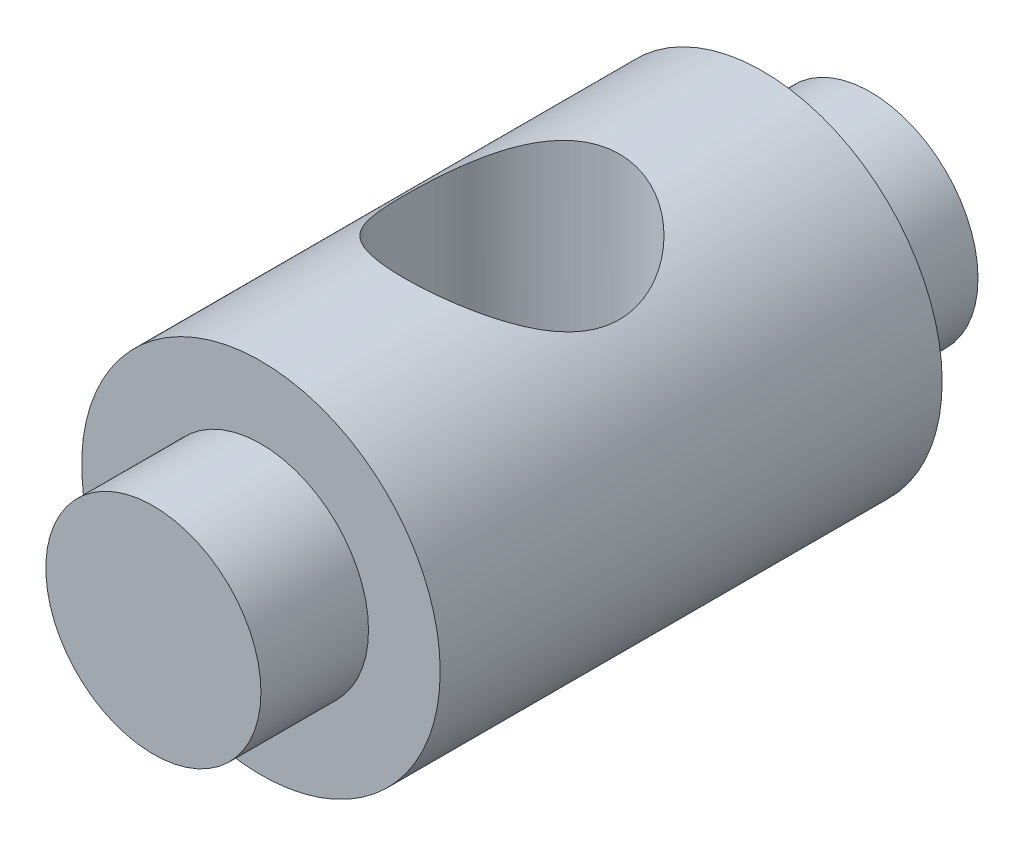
ISO-10303-21;
HEADER;
FILE_DESCRIPTION(('STEP AP214'),'2;1');
FILE_NAME('part.step','',(''),(''),'','','');
FILE_SCHEMA(('AUTOMOTIVE_DESIGN { 1 0 10303 214 1 1 1 1 }'));
ENDSEC;
DATA;
#1=APPLICATION_CONTEXT('core data for automotive mechanical design processes');
#2=APPLICATION_PROTOCOL_DEFINITION('international standard','automotive_design',2000,#1);
#3=PRODUCT_CONTEXT('',#1,'mechanical');
#4=PRODUCT('Part','Part','',(#3));
#5=PRODUCT_RELATED_PRODUCT_CATEGORY('part','',(#4));
#6=PRODUCT_DEFINITION_FORMATION('','',#4);
#7=PRODUCT_DEFINITION_CONTEXT('part definition',#1,'design');
#8=PRODUCT_DEFINITION('design','',#6,#7);
#9=PRODUCT_DEFINITION_SHAPE('','',#8);
#10=(LENGTH_UNIT() NAMED_UNIT(*) SI_UNIT(.MILLI.,.METRE.));
#11=(NAMED_UNIT(*) PLANE_ANGLE_UNIT() SI_UNIT($,.RADIAN.));
#12=(NAMED_UNIT(*) SI_UNIT($,.STERADIAN.) SOLID_ANGLE_UNIT());
#13=UNCERTAINTY_MEASURE_WITH_UNIT(LENGTH_MEASURE(1.E-05),#10,'distance_accuracy_value','');
#14=(GEOMETRIC_REPRESENTATION_CONTEXT(3) GLOBAL_UNCERTAINTY_ASSIGNED_CONTEXT((#13)) GLOBAL_UNIT_ASSIGNED_CONTEXT((#10,
#11,#12)) REPRESENTATION_CONTEXT('',''));
#15=CARTESIAN_POINT('',(0.,0.,0.));
#16=DIRECTION('',(0.,0.,1.));
#17=DIRECTION('',(1.,0.,0.));
#18=AXIS2_PLACEMENT_3D('',#15,#16,#17);
#19=CARTESIAN_POINT('',(0.,0.,-7.));
#20=DIRECTION('',(0.,0.,1.));
#21=DIRECTION('',(1.,0.,0.));
#22=AXIS2_PLACEMENT_3D('',#19,#20,#21);
#23=CYLINDRICAL_SURFACE('',#22,5.);
#24=CARTESIAN_POINT('',(0.,5.,3.));
#25=CARTESIAN_POINT('',(0.0767697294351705,4.99999907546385,2.99999894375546));
#26=CARTESIAN_POINT('',(0.153562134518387,4.99822567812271,2.99704640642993));
#27=CARTESIAN_POINT('',(0.306548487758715,4.99118362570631,2.98528576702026));
#28=CARTESIAN_POINT('',(0.382742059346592,4.98591292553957,2.97647423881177));
#29=CARTESIAN_POINT('',(0.609808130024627,4.96499345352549,2.94135144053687));
#30=CARTESIAN_POINT('',(0.758981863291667,4.94423772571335,2.90635229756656));
#31=CARTESIAN_POINT('',(1.04754167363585,4.89123238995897,2.81522725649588));
#32=CARTESIAN_POINT('',(1.18697226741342,4.8590397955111,2.75920607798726));
#33=CARTESIAN_POINT('',(1.45405042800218,4.7859070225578,2.62827933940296));
#34=CARTESIAN_POINT('',(1.58170090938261,4.74496901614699,2.55337846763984));
#35=CARTESIAN_POINT('',(1.83260160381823,4.65410731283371,2.38045034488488));
#36=CARTESIAN_POINT('',(1.95476885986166,4.60373587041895,2.28109260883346));
#37=CARTESIAN_POINT('',(2.1817645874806,4.50060875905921,2.06506559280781));
#38=CARTESIAN_POINT('',(2.28657046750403,4.4478500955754,1.94837412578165));
#39=CARTESIAN_POINT('',(2.48890019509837,4.33822134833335,1.68415297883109));
#40=CARTESIAN_POINT('',(2.5839553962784,4.28164035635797,1.53459645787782));
#41=CARTESIAN_POINT('',(2.74722868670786,4.17876602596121,1.21830685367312));
#42=CARTESIAN_POINT('',(2.8154903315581,4.13245604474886,1.05160220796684));
#43=CARTESIAN_POINT('',(2.90881204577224,4.06709259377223,0.746807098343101));
#44=CARTESIAN_POINT('',(2.94032394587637,4.04415766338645,0.611528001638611));
#45=CARTESIAN_POINT('',(2.98432344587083,4.01180616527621,0.336392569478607));
#46=CARTESIAN_POINT('',(2.99683469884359,4.00237279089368,0.196542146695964));
#47=CARTESIAN_POINT('',(3.0021101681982,3.99841845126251,-0.0840229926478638));
#48=CARTESIAN_POINT('',(2.99483563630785,4.00392674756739,-0.224738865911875));
#49=CARTESIAN_POINT('',(2.96092124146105,4.02906522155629,-0.502557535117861));
#50=CARTESIAN_POINT('',(2.93426681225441,4.04870602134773,-0.63965753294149));
#51=CARTESIAN_POINT('',(2.86347831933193,4.09906376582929,-0.90506054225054));
#52=CARTESIAN_POINT('',(2.8195745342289,4.12963433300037,-1.03345432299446));
#53=CARTESIAN_POINT('',(2.7159016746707,4.19854092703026,-1.2813897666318));
#54=CARTESIAN_POINT('',(2.65612678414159,4.2368797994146,-1.40092816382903));
#55=CARTESIAN_POINT('',(2.5103577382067,4.32510698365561,-1.64996913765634));
#56=CARTESIAN_POINT('',(2.42160671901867,4.3758426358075,-1.77755999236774));
#57=CARTESIAN_POINT('',(2.22582963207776,4.4786102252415,-2.01734915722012));
#58=CARTESIAN_POINT('',(2.11878609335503,4.53064336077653,-2.12953256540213));
#59=CARTESIAN_POINT('',(1.87159040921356,4.63871766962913,-2.35124225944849));
#60=CARTESIAN_POINT('',(1.72890315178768,4.69430681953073,-2.45821939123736));
#61=CARTESIAN_POINT('',(1.50061053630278,4.77018325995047,-2.59926871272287));
#62=CARTESIAN_POINT('',(1.42209821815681,4.79423315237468,-2.64306413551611));
#63=CARTESIAN_POINT('',(1.26074368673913,4.83916496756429,-2.723718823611));
#64=CARTESIAN_POINT('',(1.17790417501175,4.86004883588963,-2.76058235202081));
#65=CARTESIAN_POINT('',(1.01376371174,4.8968267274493,-2.82481144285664));
#66=CARTESIAN_POINT('',(0.932690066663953,4.91295100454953,-2.85262656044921));
#67=CARTESIAN_POINT('',(0.767879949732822,4.94139126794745,-2.90133395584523));
#68=CARTESIAN_POINT('',(0.684144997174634,4.95370938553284,-2.92223010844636));
#69=CARTESIAN_POINT('',(0.51474446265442,4.97416370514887,-2.95677185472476));
#70=CARTESIAN_POINT('',(0.429080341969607,4.98230296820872,-2.97042275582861));
#71=CARTESIAN_POINT('',(0.256621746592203,4.99415996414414,-2.9902661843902));
#72=CARTESIAN_POINT('',(0.169827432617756,4.99787831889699,-2.99645976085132));
#73=CARTESIAN_POINT('',(-0.0673242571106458,5.00179157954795,-3.00299267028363));
#74=CARTESIAN_POINT('',(-0.218056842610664,4.99746512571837,-2.9958115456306));
#75=CARTESIAN_POINT('',(-0.515686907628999,4.97557955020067,-2.9591544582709));
#76=CARTESIAN_POINT('',(-0.662584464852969,4.95802069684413,-2.92967894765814));
#77=CARTESIAN_POINT('',(-0.945142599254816,4.91189447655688,-2.85091154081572));
#78=CARTESIAN_POINT('',(-1.08098954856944,4.88360514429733,-2.80211887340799));
#79=CARTESIAN_POINT('',(-1.34253345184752,4.81827798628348,-2.68664567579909));
#80=CARTESIAN_POINT('',(-1.46822839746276,4.78123843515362,-2.61996161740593));
#81=CARTESIAN_POINT('',(-1.7200119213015,4.69690981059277,-2.46288590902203));
#82=CARTESIAN_POINT('',(-1.84478813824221,4.6489560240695,-2.37075230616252));
#83=CARTESIAN_POINT('',(-2.07805222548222,4.54948534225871,-2.16921724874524));
#84=CARTESIAN_POINT('',(-2.18652085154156,4.49796434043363,-2.05979570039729));
#85=CARTESIAN_POINT('',(-2.39863988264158,4.38890846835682,-1.81017920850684));
#86=CARTESIAN_POINT('',(-2.49982037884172,4.33146483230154,-1.66783222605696));
#87=CARTESIAN_POINT('',(-2.67690479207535,4.22432364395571,-1.36556795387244));
#88=CARTESIAN_POINT('',(-2.75283533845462,4.1746179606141,-1.20566941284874));
#89=CARTESIAN_POINT('',(-2.86285157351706,4.09969818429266,-0.907513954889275));
#90=CARTESIAN_POINT('',(-2.90243250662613,4.07151318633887,-0.772039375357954));
#91=CARTESIAN_POINT('',(-2.96227327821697,4.02819211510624,-0.494935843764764));
#92=CARTESIAN_POINT('',(-2.98255990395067,4.01303795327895,-0.353315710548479));
#93=CARTESIAN_POINT('',(-3.00268261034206,3.99800893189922,-0.0672461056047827));
#94=CARTESIAN_POINT('',(-3.00244179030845,3.99819152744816,0.0772119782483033));
#95=CARTESIAN_POINT('',(-2.98132945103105,4.01395435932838,0.3637888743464));
#96=CARTESIAN_POINT('',(-2.96044671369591,4.02954296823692,0.505906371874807));
#97=CARTESIAN_POINT('',(-2.90080351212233,4.07266369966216,0.776976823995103));
#98=CARTESIAN_POINT('',(-2.86295284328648,4.09958421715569,0.906234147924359));
#99=CARTESIAN_POINT('',(-2.77126473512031,4.16211005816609,1.15667454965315));
#100=CARTESIAN_POINT('',(-2.7174212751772,4.19771865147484,1.27785456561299));
#101=CARTESIAN_POINT('',(-2.58578536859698,4.28025972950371,1.52863953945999));
#102=CARTESIAN_POINT('',(-2.50558518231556,4.32809142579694,1.65668150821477));
#103=CARTESIAN_POINT('',(-2.32751213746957,4.42640286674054,1.8987608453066));
#104=CARTESIAN_POINT('',(-2.22962472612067,4.47688476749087,2.01278655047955));
#105=CARTESIAN_POINT('',(-2.00020353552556,4.5845123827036,2.24269884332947));
#106=CARTESIAN_POINT('',(-1.86578571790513,4.64140045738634,2.35584987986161));
#107=CARTESIAN_POINT('',(-1.57689277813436,4.74731429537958,2.55820798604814));
#108=CARTESIAN_POINT('',(-1.42241049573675,4.79633723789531,2.64740647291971));
#109=CARTESIAN_POINT('',(-1.18102189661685,4.85920558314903,2.75912447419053));
#110=CARTESIAN_POINT('',(-1.10025014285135,4.87817139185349,2.79233599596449));
#111=CARTESIAN_POINT('',(-0.935442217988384,4.91243413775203,2.85177213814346));
#112=CARTESIAN_POINT('',(-0.851407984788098,4.9277332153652,2.87800083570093));
#113=CARTESIAN_POINT('',(-0.681001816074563,4.95415527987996,2.92300944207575));
#114=CARTESIAN_POINT('',(-0.594637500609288,4.9652904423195,2.94181107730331));
#115=CARTESIAN_POINT('',(-0.420183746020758,4.98308318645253,2.97174435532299));
#116=CARTESIAN_POINT('',(-0.332095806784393,4.98974449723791,2.98288238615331));
#117=CARTESIAN_POINT('',(-0.203123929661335,4.99603728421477,2.99339168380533));
#118=CARTESIAN_POINT('',(-0.162556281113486,4.99752198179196,2.995868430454));
#119=CARTESIAN_POINT('',(-0.0813278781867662,4.99950360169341,2.99917289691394));
#120=CARTESIAN_POINT('',(-0.040667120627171,5.00000048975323,3.00000055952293));
#121=CARTESIAN_POINT('',(0.,5.,3.));
#122=B_SPLINE_CURVE_WITH_KNOTS('',3,(#24,#25,#26,#27,#28,#29,#30,#31,#32,#33,#34,#35,#36,#37,
#38,#39,#40,#41,#42,#43,#44,#45,#46,#47,#48,#49,#50,#51,#52,#53,#54,#55,#56,#57,#58,#59,#60,#61,
#62,#63,#64,#65,#66,#67,#68,#69,#70,#71,#72,#73,#74,#75,#76,#77,#78,#79,#80,#81,#82,#83,#84,#85,
#86,#87,#88,#89,#90,#91,#92,#93,#94,#95,#96,#97,#98,#99,#100,#101,#102,#103,#104,#105,#106,#107,
#108,#109,#110,#111,#112,#113,#114,#115,#116,#117,#118,#119,#120,#121),.UNSPECIFIED.,.T.,.F.,(4,
2,2,2,2,2,2,2,2,2,2,2,2,2,2,2,2,2,2,2,2,2,2,2,2,2,2,2,2,2,2,2,2,2,2,2,2,2,2,2,2,2,2,2,2,2,2,2,
4),(0.,0.230263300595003,0.4606613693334,0.922002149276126,1.38107466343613,1.84003329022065,
2.33408870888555,2.82878205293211,3.38413315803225,3.93857770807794,4.35913349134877,
4.77916531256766,5.20002031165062,5.62119195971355,6.03692224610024,6.45280509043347,
6.94139679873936,7.43045779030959,7.98767605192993,8.26653157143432,8.54521503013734,
8.80648473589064,9.06760787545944,9.32853946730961,9.58943435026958,10.0398406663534,
10.490237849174,10.9296843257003,11.3692175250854,11.8543559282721,12.3400624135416,
12.8890638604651,13.437484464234,13.8674843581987,14.2968863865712,14.7278971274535,
15.1591422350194,15.5696105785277,15.9802336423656,16.4539008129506,16.927959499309,
17.4794148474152,18.0310675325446,18.2988384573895,18.5664526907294,18.8332781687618,
19.0998809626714,19.221853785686,19.3438308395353),.UNSPECIFIED.);
#123=CARTESIAN_POINT('',(0.,5.,3.));
#124=VERTEX_POINT('',#123);
#125=EDGE_CURVE('E10',#124,#124,#122,.T.);
#126=ORIENTED_EDGE('',*,*,#125,.F.);
#127=EDGE_LOOP('',(#126));
#128=FACE_BOUND('',#127,.T.);
#129=CARTESIAN_POINT('',(0.,0.,-7.));
#130=DIRECTION('',(0.,0.,1.));
#131=DIRECTION('',(1.,0.,0.));
#132=AXIS2_PLACEMENT_3D('',#129,#130,#131);
#133=CIRCLE('',#132,5.);
#134=CARTESIAN_POINT('',(5.,0.,-7.));
#135=VERTEX_POINT('',#134);
#136=EDGE_CURVE('E54',#135,#135,#133,.T.);
#137=ORIENTED_EDGE('',*,*,#136,.T.);
#138=EDGE_LOOP('',(#137));
#139=FACE_BOUND('',#138,.T.);
#140=CARTESIAN_POINT('',(0.,0.,7.));
#141=DIRECTION('',(0.,0.,1.));
#142=DIRECTION('',(1.,0.,0.));
#143=AXIS2_PLACEMENT_3D('',#140,#141,#142);
#144=CIRCLE('',#143,5.);
#145=CARTESIAN_POINT('',(5.,0.,7.));
#146=VERTEX_POINT('',#145);
#147=EDGE_CURVE('E60',#146,#146,#144,.T.);
#148=ORIENTED_EDGE('',*,*,#147,.F.);
#149=EDGE_LOOP('',(#148));
#150=FACE_BOUND('',#149,.T.);
#151=ADVANCED_FACE('F37',(#128,#139,#150),#23,.T.);
#152=CARTESIAN_POINT('',(0.,0.,-7.));
#153=DIRECTION('',(0.,0.,1.));
#154=DIRECTION('',(1.,0.,0.));
#155=AXIS2_PLACEMENT_3D('',#152,#153,#154);
#156=PLANE('',#155);
#157=CARTESIAN_POINT('',(0.,0.,-7.));
#158=DIRECTION('',(0.,0.,1.));
#159=DIRECTION('',(1.,0.,0.));
#160=AXIS2_PLACEMENT_3D('',#157,#158,#159);
#161=CIRCLE('',#160,3.);
#162=CARTESIAN_POINT('',(3.,0.,-7.));
#163=VERTEX_POINT('',#162);
#164=EDGE_CURVE('E76',#163,#163,#161,.T.);
#165=ORIENTED_EDGE('',*,*,#164,.T.);
#166=EDGE_LOOP('',(#165));
#167=FACE_BOUND('',#166,.T.);
#168=ORIENTED_EDGE('',*,*,#136,.F.);
#169=EDGE_LOOP('',(#168));
#170=FACE_BOUND('',#169,.T.);
#171=ADVANCED_FACE('F103',(#167,#170),#156,.F.);
#172=CARTESIAN_POINT('',(0.,0.,7.));
#173=DIRECTION('',(0.,0.,1.));
#174=DIRECTION('',(1.,0.,0.));
#175=AXIS2_PLACEMENT_3D('',#172,#173,#174);
#176=PLANE('',#175);
#177=CARTESIAN_POINT('',(0.,0.,7.));
#178=DIRECTION('',(0.,0.,1.));
#179=DIRECTION('',(1.,0.,0.));
#180=AXIS2_PLACEMENT_3D('',#177,#178,#179);
#181=CIRCLE('',#180,3.);
#182=CARTESIAN_POINT('',(3.,0.,7.));
#183=VERTEX_POINT('',#182);
#184=EDGE_CURVE('E49',#183,#183,#181,.T.);
#185=ORIENTED_EDGE('',*,*,#184,.F.);
#186=EDGE_LOOP('',(#185));
#187=FACE_BOUND('',#186,.T.);
#188=ORIENTED_EDGE('',*,*,#147,.T.);
#189=EDGE_LOOP('',(#188));
#190=FACE_BOUND('',#189,.T.);
#191=ADVANCED_FACE('F108',(#187,#190),#176,.T.);
#192=CARTESIAN_POINT('',(0.,0.,10.));
#193=DIRECTION('',(0.,0.,-1.));
#194=DIRECTION('',(-1.,0.,0.));
#195=AXIS2_PLACEMENT_3D('',#192,#193,#194);
#196=CYLINDRICAL_SURFACE('',#195,3.);
#197=CARTESIAN_POINT('',(0.,0.,10.));
#198=DIRECTION('',(0.,0.,1.));
#199=DIRECTION('',(1.,0.,0.));
#200=AXIS2_PLACEMENT_3D('',#197,#198,#199);
#201=CIRCLE('',#200,3.);
#202=CARTESIAN_POINT('',(3.,0.,10.));
#203=VERTEX_POINT('',#202);
#204=EDGE_CURVE('E63',#203,#203,#201,.T.);
#205=ORIENTED_EDGE('',*,*,#204,.F.);
#206=EDGE_LOOP('',(#205));
#207=FACE_BOUND('',#206,.T.);
#208=ORIENTED_EDGE('',*,*,#184,.T.);
#209=EDGE_LOOP('',(#208));
#210=FACE_BOUND('',#209,.T.);
#211=ADVANCED_FACE('F117',(#207,#210),#196,.T.);
#212=CARTESIAN_POINT('',(0.,0.,10.));
#213=DIRECTION('',(0.,0.,1.));
#214=DIRECTION('',(1.,0.,0.));
#215=AXIS2_PLACEMENT_3D('',#212,#213,#214);
#216=PLANE('',#215);
#217=ORIENTED_EDGE('',*,*,#204,.T.);
#218=EDGE_LOOP('',(#217));
#219=FACE_BOUND('',#218,.T.);
#220=ADVANCED_FACE('F123',(#219),#216,.T.);
#221=CARTESIAN_POINT('',(0.,0.,-10.));
#222=DIRECTION('',(0.,0.,1.));
#223=DIRECTION('',(1.,0.,0.));
#224=AXIS2_PLACEMENT_3D('',#221,#222,#223);
#225=CYLINDRICAL_SURFACE('',#224,3.);
#226=CARTESIAN_POINT('',(0.,0.,-10.));
#227=DIRECTION('',(0.,0.,1.));
#228=DIRECTION('',(1.,0.,0.));
#229=AXIS2_PLACEMENT_3D('',#226,#227,#228);
#230=CIRCLE('',#229,3.);
#231=CARTESIAN_POINT('',(3.,0.,-10.));
#232=VERTEX_POINT('',#231);
#233=EDGE_CURVE('E71',#232,#232,#230,.T.);
#234=ORIENTED_EDGE('',*,*,#233,.T.);
#235=EDGE_LOOP('',(#234));
#236=FACE_BOUND('',#235,.T.);
#237=ORIENTED_EDGE('',*,*,#164,.F.);
#238=EDGE_LOOP('',(#237));
#239=FACE_BOUND('',#238,.T.);
#240=ADVANCED_FACE('F98',(#236,#239),#225,.T.);
#241=CARTESIAN_POINT('',(0.,0.,-10.));
#242=DIRECTION('',(0.,0.,-1.));
#243=DIRECTION('',(1.,0.,0.));
#244=AXIS2_PLACEMENT_3D('',#241,#242,#243);
#245=PLANE('',#244);
#246=ORIENTED_EDGE('',*,*,#233,.F.);
#247=EDGE_LOOP('',(#246));
#248=FACE_BOUND('',#247,.T.);
#249=ADVANCED_FACE('F92',(#248),#245,.T.);
#250=CARTESIAN_POINT('',(0.,0.,0.));
#251=DIRECTION('',(0.,1.,0.));
#252=DIRECTION('',(0.,0.,1.));
#253=AXIS2_PLACEMENT_3D('',#250,#251,#252);
#254=CYLINDRICAL_SURFACE('',#253,3.);
#255=ORIENTED_EDGE('',*,*,#125,.T.);
#256=EDGE_LOOP('',(#255));
#257=FACE_BOUND('',#256,.T.);
#258=CARTESIAN_POINT('',(0.,0.,0.));
#259=DIRECTION('',(0.,1.,0.));
#260=DIRECTION('',(0.,0.,1.));
#261=AXIS2_PLACEMENT_3D('',#258,#259,#260);
#262=CIRCLE('',#261,3.);
#263=CARTESIAN_POINT('',(0.,0.,3.));
#264=VERTEX_POINT('',#263);
#265=EDGE_CURVE('E82',#264,#264,#262,.T.);
#266=ORIENTED_EDGE('',*,*,#265,.F.);
#267=EDGE_LOOP('',(#266));
#268=FACE_BOUND('',#267,.T.);
#269=ADVANCED_FACE('F90',(#257,#268),#254,.F.);
#270=CARTESIAN_POINT('',(0.,0.,0.));
#271=DIRECTION('',(0.,1.,0.));
#272=DIRECTION('',(0.,0.,1.));
#273=AXIS2_PLACEMENT_3D('',#270,#271,#272);
#274=PLANE('',#273);
#275=ORIENTED_EDGE('',*,*,#265,.T.);
#276=EDGE_LOOP('',(#275));
#277=FACE_BOUND('',#276,.T.);
#278=ADVANCED_FACE('F88',(#277),#274,.T.);
#279=CLOSED_SHELL('',(#151,#171,#191,#211,#220,#240,#249,#269,#278));
#280=MANIFOLD_SOLID_BREP('B2',#279);
#281=ADVANCED_BREP_SHAPE_REPRESENTATION('',(#18,#280),#14);
#282=SHAPE_DEFINITION_REPRESENTATION(#9,#281);
ENDSEC;
END-ISO-10303-21;
